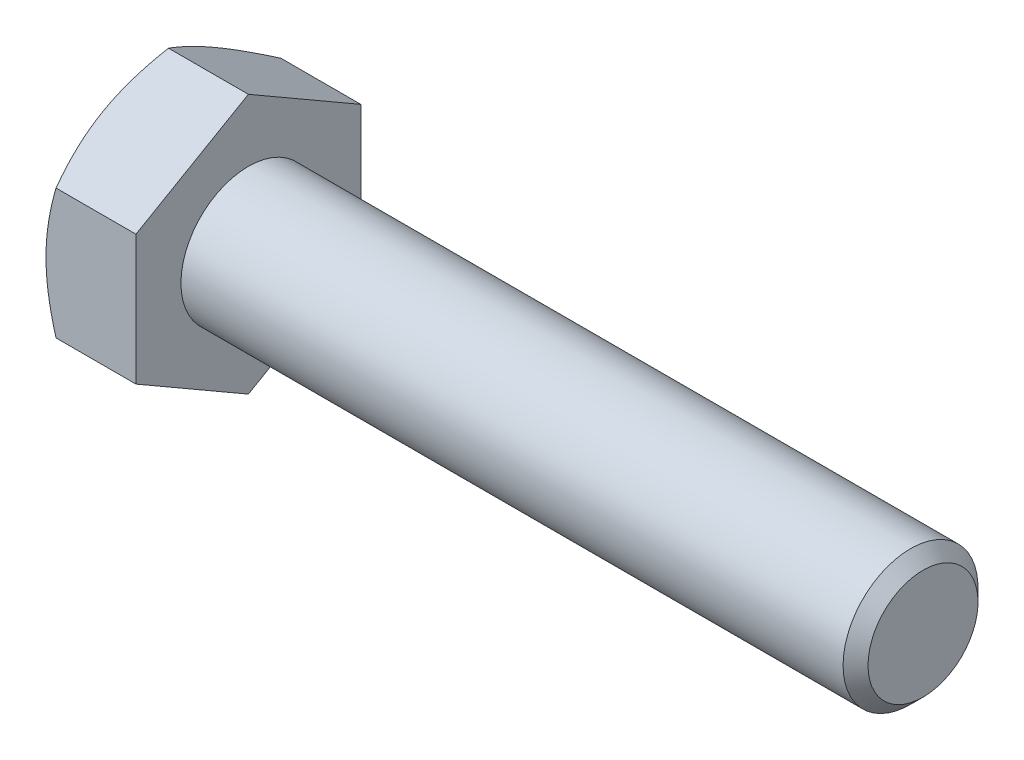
from build123d import *

# Parameters (mm, degrees)
BASEHEAD_DEPTH = 4


with BuildPart() as part:
    # Sketch1 → BaseHead (new body)
    with BuildSketch(Plane(origin=(0, 0, 0), x_dir=(0, 0, -1), z_dir=(1, 0, 0))):
        Polygon((5, 2.886751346), (5, -2.886751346), (0, -5.773502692), (-5, -2.886751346), (-5, 2.886751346), (0, 5.773502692), align=None)
    extrude(amount=BASEHEAD_DEPTH)

    # BodySke → BaseBody (revolve)
    with BuildSketch(Plane.XY, mode=Mode.PRIVATE) as basebody_sk:
        Polygon((0, 0), (34, 0), (34, 2.4455), (33.4455, 3), (0, 3), align=None)
    revolve(basebody_sk.sketch.rotate(Axis((0, 0, 0), (1, 0, 0)), 90), axis=Axis((0, 0, 0), (1, 0, 0)))

    # Sketch3 → HeadChamfer (revolve, cut)
    with BuildSketch(Plane.XY):
        Polygon((0, 5), (3.333333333, 10.773502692), (3.333333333, 15.773502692), (-10, 15.773502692), (-10, 5), align=None)
    revolve(axis=Axis((0, 0, 0), (1, 0, 0)), mode=Mode.SUBTRACT)


solid = part.part
